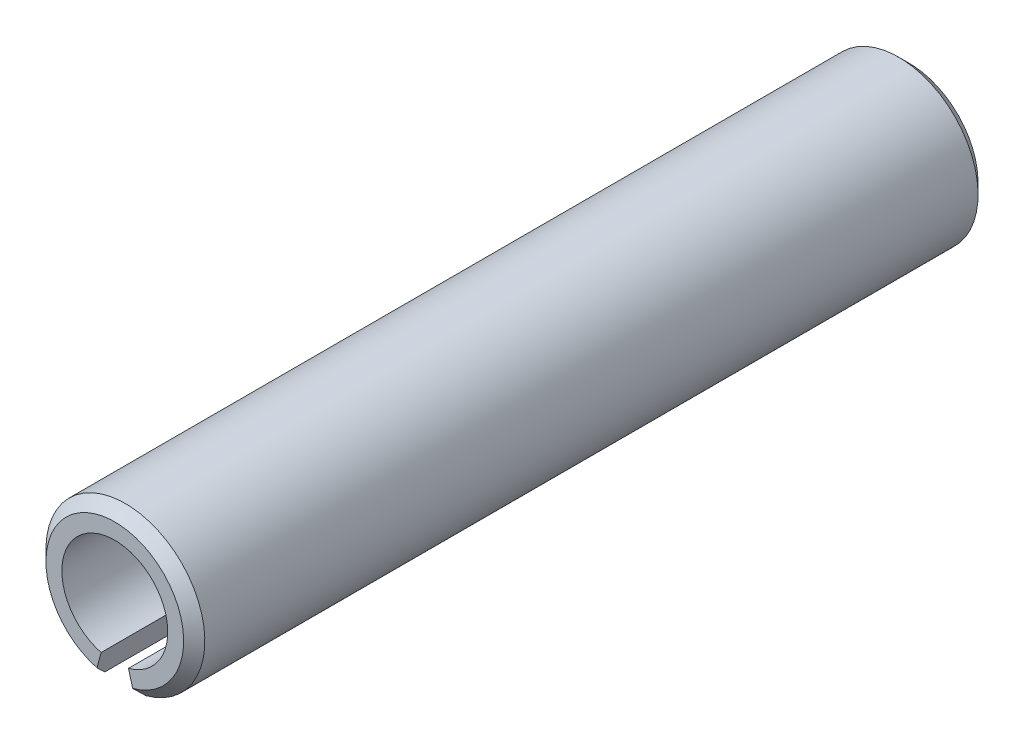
ISO-10303-21;
HEADER;
FILE_DESCRIPTION(('STEP AP214'),'2;1');
FILE_NAME('part.step','',(''),(''),'','','');
FILE_SCHEMA(('AUTOMOTIVE_DESIGN { 1 0 10303 214 1 1 1 1 }'));
ENDSEC;
DATA;
#1=APPLICATION_CONTEXT('core data for automotive mechanical design processes');
#2=APPLICATION_PROTOCOL_DEFINITION('international standard','automotive_design',2000,#1);
#3=PRODUCT_CONTEXT('',#1,'mechanical');
#4=PRODUCT('Part','Part','',(#3));
#5=PRODUCT_RELATED_PRODUCT_CATEGORY('part','',(#4));
#6=PRODUCT_DEFINITION_FORMATION('','',#4);
#7=PRODUCT_DEFINITION_CONTEXT('part definition',#1,'design');
#8=PRODUCT_DEFINITION('design','',#6,#7);
#9=PRODUCT_DEFINITION_SHAPE('','',#8);
#10=(LENGTH_UNIT() NAMED_UNIT(*) SI_UNIT(.MILLI.,.METRE.));
#11=(NAMED_UNIT(*) PLANE_ANGLE_UNIT() SI_UNIT($,.RADIAN.));
#12=(NAMED_UNIT(*) SI_UNIT($,.STERADIAN.) SOLID_ANGLE_UNIT());
#13=UNCERTAINTY_MEASURE_WITH_UNIT(LENGTH_MEASURE(1.E-05),#10,'distance_accuracy_value','');
#14=(GEOMETRIC_REPRESENTATION_CONTEXT(3) GLOBAL_UNCERTAINTY_ASSIGNED_CONTEXT((#13)) GLOBAL_UNIT_ASSIGNED_CONTEXT((#10,
#11,#12)) REPRESENTATION_CONTEXT('',''));
#15=CARTESIAN_POINT('',(0.,0.,0.));
#16=DIRECTION('',(0.,0.,1.));
#17=DIRECTION('',(1.,0.,0.));
#18=AXIS2_PLACEMENT_3D('',#15,#16,#17);
#19=CARTESIAN_POINT('',(0.,0.,15.));
#20=DIRECTION('',(0.,0.,-1.));
#21=DIRECTION('',(-1.,0.,0.));
#22=AXIS2_PLACEMENT_3D('',#19,#20,#21);
#23=CYLINDRICAL_SURFACE('',#22,1.5);
#24=DIRECTION('',(0.,0.,-1.));
#25=VECTOR('',#24,1.);
#26=CARTESIAN_POINT('',(-0.388228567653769,-1.44888873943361,15.));
#27=LINE('',#26,#25);
#28=CARTESIAN_POINT('',(-0.388228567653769,-1.44888873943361,14.8));
#29=VERTEX_POINT('',#28);
#30=CARTESIAN_POINT('',(-0.388228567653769,-1.44888873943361,0.200000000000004));
#31=VERTEX_POINT('',#30);
#32=EDGE_CURVE('E426',#29,#31,#27,.T.);
#33=ORIENTED_EDGE('',*,*,#32,.F.);
#34=CARTESIAN_POINT('',(0.,0.,14.8));
#35=DIRECTION('',(0.,0.,1.));
#36=DIRECTION('',(1.,0.,0.));
#37=AXIS2_PLACEMENT_3D('',#34,#35,#36);
#38=CIRCLE('',#37,1.5);
#39=CARTESIAN_POINT('',(0.38822856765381,-1.44888873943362,14.8));
#40=VERTEX_POINT('',#39);
#41=EDGE_CURVE('E453',#29,#40,#38,.F.);
#42=ORIENTED_EDGE('',*,*,#41,.T.);
#43=DIRECTION('',(0.,0.,-1.));
#44=VECTOR('',#43,1.);
#45=CARTESIAN_POINT('',(0.388228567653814,-1.44888873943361,15.));
#46=LINE('',#45,#44);
#47=CARTESIAN_POINT('',(0.38822856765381,-1.44888873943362,0.200000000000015));
#48=VERTEX_POINT('',#47);
#49=EDGE_CURVE('E440',#40,#48,#46,.T.);
#50=ORIENTED_EDGE('',*,*,#49,.T.);
#51=CARTESIAN_POINT('',(0.,0.,0.200000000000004));
#52=DIRECTION('',(0.,0.,1.));
#53=DIRECTION('',(1.,0.,0.));
#54=AXIS2_PLACEMENT_3D('',#51,#52,#53);
#55=CIRCLE('',#54,1.5);
#56=EDGE_CURVE('E450',#48,#31,#55,.T.);
#57=ORIENTED_EDGE('',*,*,#56,.T.);
#58=EDGE_LOOP('',(#33,#42,#50,#57));
#59=FACE_BOUND('',#58,.T.);
#60=ADVANCED_FACE('F358',(#59),#23,.T.);
#61=CARTESIAN_POINT('',(-0.258819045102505,-0.965925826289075,15.));
#62=DIRECTION('',(-0.965925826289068,0.258819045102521,0.));
#63=DIRECTION('',(-0.258819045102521,-0.965925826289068,0.));
#64=AXIS2_PLACEMENT_3D('',#61,#62,#63);
#65=PLANE('',#64);
#66=DIRECTION('',(0.258819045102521,0.965925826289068,0.));
#67=VECTOR('',#66,1.);
#68=CARTESIAN_POINT('',(-0.258819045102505,-0.965925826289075,15.));
#69=LINE('',#68,#67);
#70=CARTESIAN_POINT('',(-0.336464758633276,-1.25570357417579,15.));
#71=VERTEX_POINT('',#70);
#72=CARTESIAN_POINT('',(-0.258819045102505,-0.965925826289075,15.));
#73=VERTEX_POINT('',#72);
#74=EDGE_CURVE('E432',#71,#73,#69,.T.);
#75=ORIENTED_EDGE('',*,*,#74,.F.);
#76=DIRECTION('',(0.18301270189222,0.683012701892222,0.707106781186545));
#77=VECTOR('',#76,1.);
#78=CARTESIAN_POINT('',(0.,0.,16.3));
#79=LINE('',#78,#77);
#80=EDGE_CURVE('E448',#71,#29,#79,.F.);
#81=ORIENTED_EDGE('',*,*,#80,.T.);
#82=ORIENTED_EDGE('',*,*,#32,.T.);
#83=DIRECTION('',(-0.183012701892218,-0.683012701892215,0.707106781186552));
#84=VECTOR('',#83,1.);
#85=CARTESIAN_POINT('',(0.,0.,-1.30000000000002));
#86=LINE('',#85,#84);
#87=CARTESIAN_POINT('',(-0.336464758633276,-1.25570357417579,0.));
#88=VERTEX_POINT('',#87);
#89=EDGE_CURVE('E417',#31,#88,#86,.F.);
#90=ORIENTED_EDGE('',*,*,#89,.T.);
#91=DIRECTION('',(0.258819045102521,0.965925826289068,0.));
#92=VECTOR('',#91,1.);
#93=CARTESIAN_POINT('',(-0.258819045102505,-0.965925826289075,0.));
#94=LINE('',#93,#92);
#95=CARTESIAN_POINT('',(-0.258819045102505,-0.965925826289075,0.));
#96=VERTEX_POINT('',#95);
#97=EDGE_CURVE('E410',#88,#96,#94,.T.);
#98=ORIENTED_EDGE('',*,*,#97,.T.);
#99=DIRECTION('',(0.,0.,-1.));
#100=VECTOR('',#99,1.);
#101=CARTESIAN_POINT('',(-0.258819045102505,-0.965925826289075,15.));
#102=LINE('',#101,#100);
#103=EDGE_CURVE('E414',#73,#96,#102,.T.);
#104=ORIENTED_EDGE('',*,*,#103,.F.);
#105=EDGE_LOOP('',(#75,#81,#82,#90,#98,#104));
#106=FACE_BOUND('',#105,.T.);
#107=ADVANCED_FACE('F413',(#106),#65,.F.);
#108=CARTESIAN_POINT('',(0.,0.,15.));
#109=DIRECTION('',(0.,0.,-1.));
#110=DIRECTION('',(-1.,0.,0.));
#111=AXIS2_PLACEMENT_3D('',#108,#109,#110);
#112=CYLINDRICAL_SURFACE('',#111,1.);
#113=CARTESIAN_POINT('',(0.,0.,0.));
#114=DIRECTION('',(0.,0.,-1.));
#115=DIRECTION('',(1.,0.,0.));
#116=AXIS2_PLACEMENT_3D('',#113,#114,#115);
#117=CIRCLE('',#116,1.);
#118=CARTESIAN_POINT('',(0.258819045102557,-0.965925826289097,0.));
#119=VERTEX_POINT('',#118);
#120=EDGE_CURVE('E419',#96,#119,#117,.T.);
#121=ORIENTED_EDGE('',*,*,#120,.T.);
#122=DIRECTION('',(0.,0.,-1.));
#123=VECTOR('',#122,1.);
#124=CARTESIAN_POINT('',(0.258819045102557,-0.965925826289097,15.));
#125=LINE('',#124,#123);
#126=CARTESIAN_POINT('',(0.258819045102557,-0.965925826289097,15.));
#127=VERTEX_POINT('',#126);
#128=EDGE_CURVE('E427',#127,#119,#125,.T.);
#129=ORIENTED_EDGE('',*,*,#128,.F.);
#130=CARTESIAN_POINT('',(0.,0.,15.));
#131=DIRECTION('',(0.,0.,-1.));
#132=DIRECTION('',(1.,0.,0.));
#133=AXIS2_PLACEMENT_3D('',#130,#131,#132);
#134=CIRCLE('',#133,1.);
#135=EDGE_CURVE('E425',#73,#127,#134,.T.);
#136=ORIENTED_EDGE('',*,*,#135,.F.);
#137=ORIENTED_EDGE('',*,*,#103,.T.);
#138=EDGE_LOOP('',(#121,#129,#136,#137));
#139=FACE_BOUND('',#138,.T.);
#140=ADVANCED_FACE('F422',(#139),#112,.F.);
#141=CARTESIAN_POINT('',(0.258819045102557,-0.965925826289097,15.));
#142=DIRECTION('',(0.965925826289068,0.258819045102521,0.));
#143=DIRECTION('',(-0.258819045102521,0.965925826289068,0.));
#144=AXIS2_PLACEMENT_3D('',#141,#142,#143);
#145=PLANE('',#144);
#146=ORIENTED_EDGE('',*,*,#49,.F.);
#147=DIRECTION('',(0.18301270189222,-0.683012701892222,-0.707106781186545));
#148=VECTOR('',#147,1.);
#149=CARTESIAN_POINT('',(0.,0.,16.3));
#150=LINE('',#149,#148);
#151=CARTESIAN_POINT('',(0.336464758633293,-1.2557035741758,15.));
#152=VERTEX_POINT('',#151);
#153=EDGE_CURVE('E365',#40,#152,#150,.F.);
#154=ORIENTED_EDGE('',*,*,#153,.T.);
#155=DIRECTION('',(0.258819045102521,-0.965925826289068,0.));
#156=VECTOR('',#155,1.);
#157=CARTESIAN_POINT('',(0.258819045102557,-0.965925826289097,15.));
#158=LINE('',#157,#156);
#159=EDGE_CURVE('E437',#127,#152,#158,.T.);
#160=ORIENTED_EDGE('',*,*,#159,.F.);
#161=ORIENTED_EDGE('',*,*,#128,.T.);
#162=DIRECTION('',(0.258819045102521,-0.965925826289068,0.));
#163=VECTOR('',#162,1.);
#164=CARTESIAN_POINT('',(0.258819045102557,-0.965925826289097,0.));
#165=LINE('',#164,#163);
#166=CARTESIAN_POINT('',(0.336464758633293,-1.2557035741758,0.));
#167=VERTEX_POINT('',#166);
#168=EDGE_CURVE('E430',#119,#167,#165,.T.);
#169=ORIENTED_EDGE('',*,*,#168,.T.);
#170=DIRECTION('',(-0.183012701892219,0.683012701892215,-0.707106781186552));
#171=VECTOR('',#170,1.);
#172=CARTESIAN_POINT('',(0.,0.,-1.30000000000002));
#173=LINE('',#172,#171);
#174=EDGE_CURVE('E377',#167,#48,#173,.F.);
#175=ORIENTED_EDGE('',*,*,#174,.T.);
#176=EDGE_LOOP('',(#146,#154,#160,#161,#169,#175));
#177=FACE_BOUND('',#176,.T.);
#178=ADVANCED_FACE('F457',(#177),#145,.F.);
#179=CARTESIAN_POINT('',(0.,0.,15.));
#180=DIRECTION('',(0.,0.,1.));
#181=DIRECTION('',(1.,0.,0.));
#182=AXIS2_PLACEMENT_3D('',#179,#180,#181);
#183=PLANE('',#182);
#184=ORIENTED_EDGE('',*,*,#159,.T.);
#185=CARTESIAN_POINT('',(0.,0.,15.));
#186=DIRECTION('',(0.,0.,1.));
#187=DIRECTION('',(1.,0.,0.));
#188=AXIS2_PLACEMENT_3D('',#185,#186,#187);
#189=CIRCLE('',#188,1.3);
#190=EDGE_CURVE('E444',#152,#71,#189,.T.);
#191=ORIENTED_EDGE('',*,*,#190,.T.);
#192=ORIENTED_EDGE('',*,*,#74,.T.);
#193=ORIENTED_EDGE('',*,*,#135,.T.);
#194=EDGE_LOOP('',(#184,#191,#192,#193));
#195=FACE_BOUND('',#194,.T.);
#196=ADVANCED_FACE('F462',(#195),#183,.T.);
#197=CARTESIAN_POINT('',(0.,0.,0.));
#198=DIRECTION('',(0.,0.,1.));
#199=DIRECTION('',(1.,0.,0.));
#200=AXIS2_PLACEMENT_3D('',#197,#198,#199);
#201=PLANE('',#200);
#202=ORIENTED_EDGE('',*,*,#97,.F.);
#203=CARTESIAN_POINT('',(0.,0.,0.));
#204=DIRECTION('',(0.,0.,1.));
#205=DIRECTION('',(1.,0.,0.));
#206=AXIS2_PLACEMENT_3D('',#203,#204,#205);
#207=CIRCLE('',#206,1.3);
#208=EDGE_CURVE('E13',#88,#167,#207,.F.);
#209=ORIENTED_EDGE('',*,*,#208,.T.);
#210=ORIENTED_EDGE('',*,*,#168,.F.);
#211=ORIENTED_EDGE('',*,*,#120,.F.);
#212=EDGE_LOOP('',(#202,#209,#210,#211));
#213=FACE_BOUND('',#212,.T.);
#214=ADVANCED_FACE('F429',(#213),#201,.F.);
#215=CARTESIAN_POINT('',(0.,0.,15.));
#216=DIRECTION('',(0.,0.,-1.));
#217=DIRECTION('',(-1.,0.,0.));
#218=AXIS2_PLACEMENT_3D('',#215,#216,#217);
#219=CONICAL_SURFACE('',#218,1.3,0.785398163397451);
#220=ORIENTED_EDGE('',*,*,#153,.F.);
#221=ORIENTED_EDGE('',*,*,#41,.F.);
#222=ORIENTED_EDGE('',*,*,#80,.F.);
#223=ORIENTED_EDGE('',*,*,#190,.F.);
#224=EDGE_LOOP('',(#220,#221,#222,#223));
#225=FACE_BOUND('',#224,.T.);
#226=ADVANCED_FACE('F463',(#225),#219,.T.);
#227=CARTESIAN_POINT('',(0.,0.,0.200000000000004));
#228=DIRECTION('',(0.,0.,1.));
#229=DIRECTION('',(1.,0.,0.));
#230=AXIS2_PLACEMENT_3D('',#227,#228,#229);
#231=CONICAL_SURFACE('',#230,1.5,0.785398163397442);
#232=ORIENTED_EDGE('',*,*,#174,.F.);
#233=ORIENTED_EDGE('',*,*,#208,.F.);
#234=ORIENTED_EDGE('',*,*,#89,.F.);
#235=ORIENTED_EDGE('',*,*,#56,.F.);
#236=EDGE_LOOP('',(#232,#233,#234,#235));
#237=FACE_BOUND('',#236,.T.);
#238=ADVANCED_FACE('F468',(#237),#231,.T.);
#239=CLOSED_SHELL('',(#60,#107,#140,#178,#196,#214,#226,#238));
#240=MANIFOLD_SOLID_BREP('B2',#239);
#241=ADVANCED_BREP_SHAPE_REPRESENTATION('',(#18,#240),#14);
#242=SHAPE_DEFINITION_REPRESENTATION(#9,#241);
ENDSEC;
END-ISO-10303-21;
